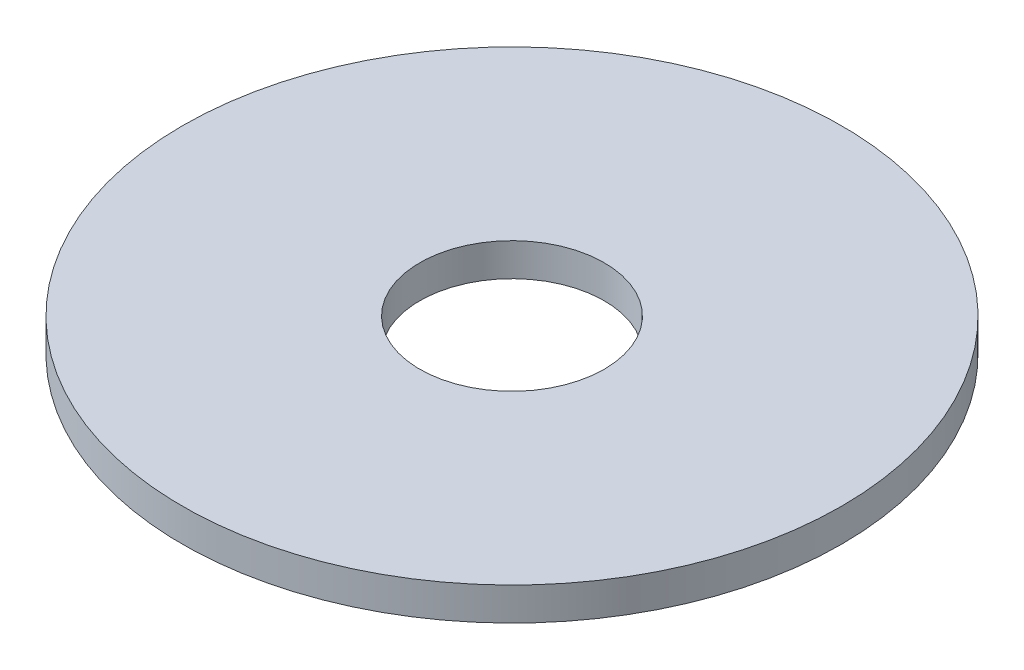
ISO-10303-21;
HEADER;
FILE_DESCRIPTION(('STEP AP214'),'2;1');
FILE_NAME('part.step','',(''),(''),'','','');
FILE_SCHEMA(('AUTOMOTIVE_DESIGN { 1 0 10303 214 1 1 1 1 }'));
ENDSEC;
DATA;
#1=APPLICATION_CONTEXT('core data for automotive mechanical design processes');
#2=APPLICATION_PROTOCOL_DEFINITION('international standard','automotive_design',2000,#1);
#3=PRODUCT_CONTEXT('',#1,'mechanical');
#4=PRODUCT('Part','Part','',(#3));
#5=PRODUCT_RELATED_PRODUCT_CATEGORY('part','',(#4));
#6=PRODUCT_DEFINITION_FORMATION('','',#4);
#7=PRODUCT_DEFINITION_CONTEXT('part definition',#1,'design');
#8=PRODUCT_DEFINITION('design','',#6,#7);
#9=PRODUCT_DEFINITION_SHAPE('','',#8);
#10=(LENGTH_UNIT() NAMED_UNIT(*) SI_UNIT(.MILLI.,.METRE.));
#11=(NAMED_UNIT(*) PLANE_ANGLE_UNIT() SI_UNIT($,.RADIAN.));
#12=(NAMED_UNIT(*) SI_UNIT($,.STERADIAN.) SOLID_ANGLE_UNIT());
#13=UNCERTAINTY_MEASURE_WITH_UNIT(LENGTH_MEASURE(1.E-05),#10,'distance_accuracy_value','');
#14=(GEOMETRIC_REPRESENTATION_CONTEXT(3) GLOBAL_UNCERTAINTY_ASSIGNED_CONTEXT((#13)) GLOBAL_UNIT_ASSIGNED_CONTEXT((#10,
#11,#12)) REPRESENTATION_CONTEXT('',''));
#15=CARTESIAN_POINT('',(0.,0.,0.));
#16=DIRECTION('',(0.,0.,1.));
#17=DIRECTION('',(1.,0.,0.));
#18=AXIS2_PLACEMENT_3D('',#15,#16,#17);
#19=CARTESIAN_POINT('',(-4.2,1.5,0.));
#20=DIRECTION('',(0.,1.,0.));
#21=DIRECTION('',(-1.,0.,0.));
#22=AXIS2_PLACEMENT_3D('',#19,#20,#21);
#23=PLANE('',#22);
#24=CARTESIAN_POINT('',(0.,1.49999999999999,0.));
#25=DIRECTION('',(0.,-1.,0.));
#26=DIRECTION('',(1.,0.,0.));
#27=AXIS2_PLACEMENT_3D('',#24,#25,#26);
#28=CIRCLE('',#27,15.);
#29=CARTESIAN_POINT('',(15.,1.49999999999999,0.));
#30=VERTEX_POINT('',#29);
#31=EDGE_CURVE('E17',#30,#30,#28,.T.);
#32=ORIENTED_EDGE('',*,*,#31,.F.);
#33=EDGE_LOOP('',(#32));
#34=FACE_BOUND('',#33,.T.);
#35=CARTESIAN_POINT('',(0.,1.5,0.));
#36=DIRECTION('',(0.,-1.,0.));
#37=DIRECTION('',(1.,0.,0.));
#38=AXIS2_PLACEMENT_3D('',#35,#36,#37);
#39=CIRCLE('',#38,4.19999999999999);
#40=CARTESIAN_POINT('',(4.19999999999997,1.5,0.));
#41=VERTEX_POINT('',#40);
#42=EDGE_CURVE('E26',#41,#41,#39,.T.);
#43=ORIENTED_EDGE('',*,*,#42,.T.);
#44=EDGE_LOOP('',(#43));
#45=FACE_BOUND('',#44,.T.);
#46=ADVANCED_FACE('F14',(#34,#45),#23,.T.);
#47=CARTESIAN_POINT('',(0.,-78.74,0.));
#48=DIRECTION('',(0.,-1.,0.));
#49=DIRECTION('',(1.,0.,0.));
#50=AXIS2_PLACEMENT_3D('',#47,#48,#49);
#51=CYLINDRICAL_SURFACE('',#50,15.);
#52=ORIENTED_EDGE('',*,*,#31,.T.);
#53=EDGE_LOOP('',(#52));
#54=FACE_BOUND('',#53,.T.);
#55=CARTESIAN_POINT('',(0.,0.,0.));
#56=DIRECTION('',(0.,-1.,0.));
#57=DIRECTION('',(1.,0.,0.));
#58=AXIS2_PLACEMENT_3D('',#55,#56,#57);
#59=CIRCLE('',#58,15.);
#60=CARTESIAN_POINT('',(15.,0.,0.));
#61=VERTEX_POINT('',#60);
#62=EDGE_CURVE('E21',#61,#61,#59,.T.);
#63=ORIENTED_EDGE('',*,*,#62,.F.);
#64=EDGE_LOOP('',(#63));
#65=FACE_BOUND('',#64,.T.);
#66=ADVANCED_FACE('F34',(#54,#65),#51,.T.);
#67=CARTESIAN_POINT('',(0.,-78.74,0.));
#68=DIRECTION('',(0.,-1.,0.));
#69=DIRECTION('',(1.,0.,0.));
#70=AXIS2_PLACEMENT_3D('',#67,#68,#69);
#71=CYLINDRICAL_SURFACE('',#70,4.19999999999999);
#72=CARTESIAN_POINT('',(0.,0.,0.));
#73=DIRECTION('',(0.,-1.,0.));
#74=DIRECTION('',(1.,0.,0.));
#75=AXIS2_PLACEMENT_3D('',#72,#73,#74);
#76=CIRCLE('',#75,4.19999999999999);
#77=CARTESIAN_POINT('',(4.19999999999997,0.,0.));
#78=VERTEX_POINT('',#77);
#79=EDGE_CURVE('E10',#78,#78,#76,.F.);
#80=ORIENTED_EDGE('',*,*,#79,.F.);
#81=EDGE_LOOP('',(#80));
#82=FACE_BOUND('',#81,.T.);
#83=ORIENTED_EDGE('',*,*,#42,.F.);
#84=EDGE_LOOP('',(#83));
#85=FACE_BOUND('',#84,.T.);
#86=ADVANCED_FACE('F42',(#82,#85),#71,.F.);
#87=CARTESIAN_POINT('',(-15.,0.,-1.04744440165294E-13));
#88=DIRECTION('',(0.,-1.,0.));
#89=DIRECTION('',(1.,0.,0.));
#90=AXIS2_PLACEMENT_3D('',#87,#88,#89);
#91=PLANE('',#90);
#92=ORIENTED_EDGE('',*,*,#79,.T.);
#93=EDGE_LOOP('',(#92));
#94=FACE_BOUND('',#93,.T.);
#95=ORIENTED_EDGE('',*,*,#62,.T.);
#96=EDGE_LOOP('',(#95));
#97=FACE_BOUND('',#96,.T.);
#98=ADVANCED_FACE('F43',(#94,#97),#91,.T.);
#99=CLOSED_SHELL('',(#46,#66,#86,#98));
#100=MANIFOLD_SOLID_BREP('B1',#99);
#101=ADVANCED_BREP_SHAPE_REPRESENTATION('',(#18,#100),#14);
#102=SHAPE_DEFINITION_REPRESENTATION(#9,#101);
ENDSEC;
END-ISO-10303-21;
